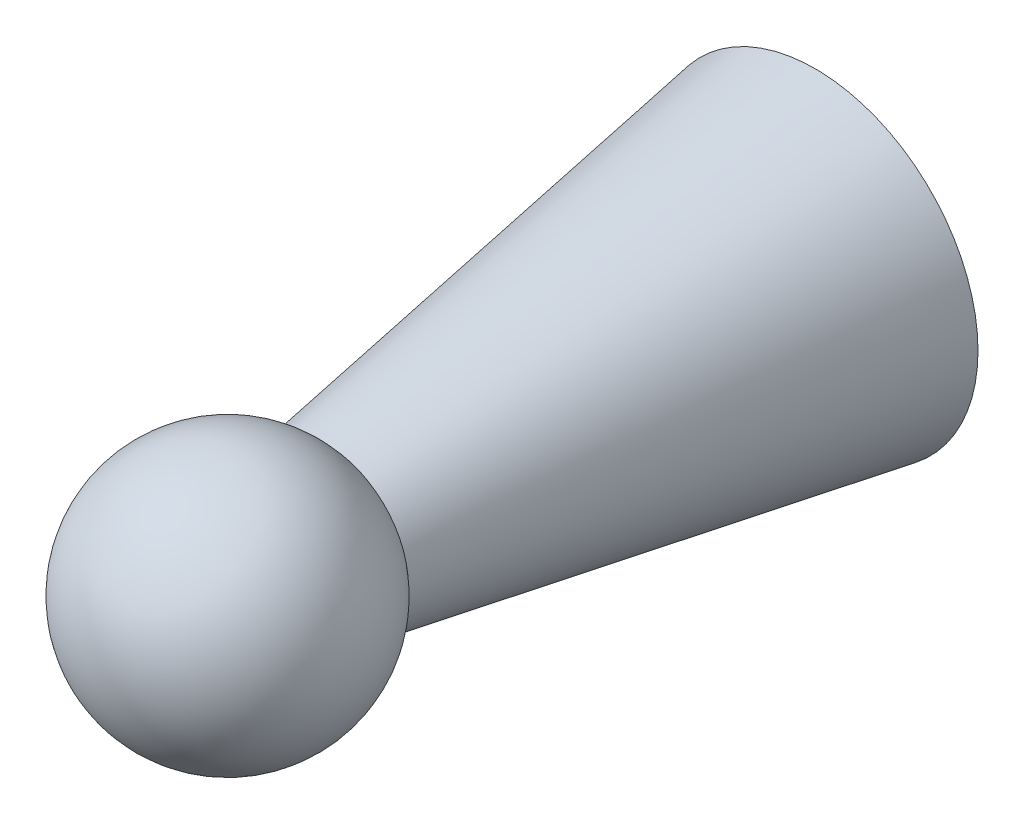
from build123d import *

# Parameters (mm, degrees)
SKETCH2_R          = 2.5
SKETCH1_R          = 5
SKETCH3_R          = 2.5
CUT_EXTRUDE1_DEPTH = 8
DOME1_FACE_RADIUS  = 2.5
DOME1_HEIGHT       = 7


with BuildPart() as part:
    # Sketch2 → Loft1 section 0
    with BuildSketch(Plane.XY.offset(15)):
        Circle(SKETCH2_R)
    # Sketch1 → Loft1 section 1
    with BuildSketch(Plane.XY):
        Circle(SKETCH1_R)
    loft()

    # Sketch3 → Cut-Extrude1 (cut)
    with BuildSketch(Plane(origin=(0, 0, 0), x_dir=(-1, 0, 0), z_dir=(0, 0, -1))):
        Circle(SKETCH3_R)
    extrude(amount=-CUT_EXTRUDE1_DEPTH, mode=Mode.SUBTRACT)

    # Dome1: a dome of height H over a round flat face of radius A is a cap of a sphere of radius (A * A + H * H) / (2 * H)
    dome1_r = (DOME1_FACE_RADIUS * DOME1_FACE_RADIUS + DOME1_HEIGHT * DOME1_HEIGHT) / (2 * DOME1_HEIGHT)
    dome1_base = Plane((0, 0, 15), z_dir=(0, 0, 1))
    with Locations(dome1_base.offset(DOME1_HEIGHT - dome1_r)):
        dome1_ball = Sphere(dome1_r, mode=Mode.PRIVATE)
    add(split(dome1_ball, bisect_by=dome1_base, keep=Keep.TOP, mode=Mode.PRIVATE))


solid = part.part
